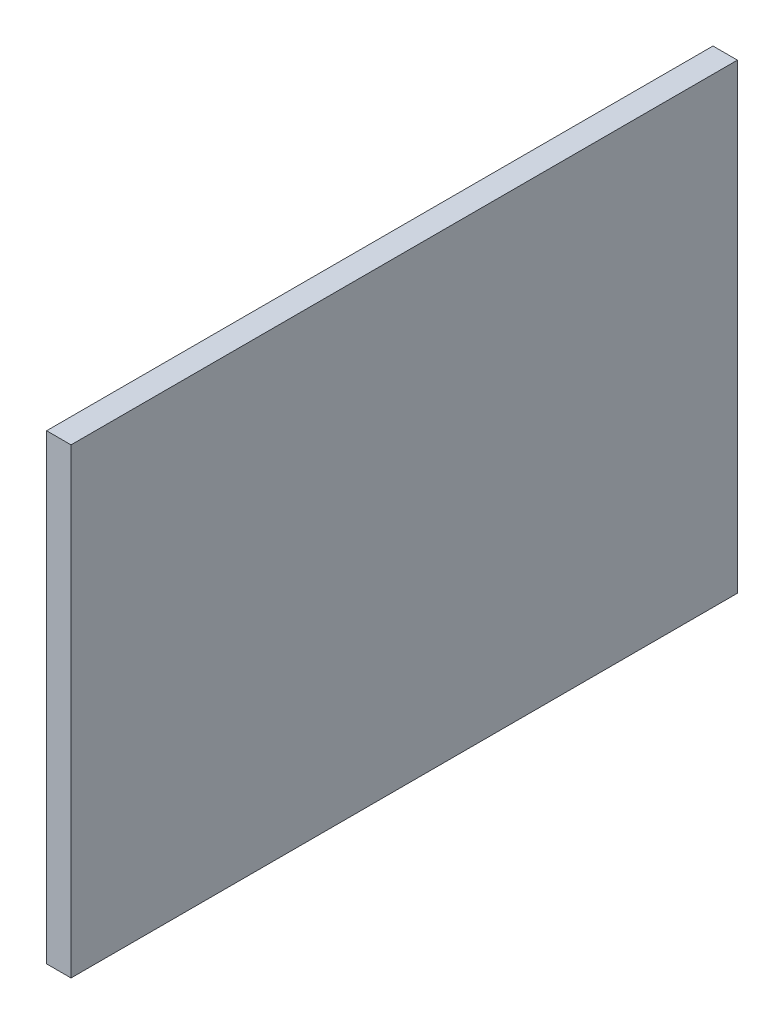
ISO-10303-21;
HEADER;
FILE_DESCRIPTION(('STEP AP214'),'2;1');
FILE_NAME('part.step','',(''),(''),'','','');
FILE_SCHEMA(('AUTOMOTIVE_DESIGN { 1 0 10303 214 1 1 1 1 }'));
ENDSEC;
DATA;
#1=APPLICATION_CONTEXT('core data for automotive mechanical design processes');
#2=APPLICATION_PROTOCOL_DEFINITION('international standard','automotive_design',2000,#1);
#3=PRODUCT_CONTEXT('',#1,'mechanical');
#4=PRODUCT('Part','Part','',(#3));
#5=PRODUCT_RELATED_PRODUCT_CATEGORY('part','',(#4));
#6=PRODUCT_DEFINITION_FORMATION('','',#4);
#7=PRODUCT_DEFINITION_CONTEXT('part definition',#1,'design');
#8=PRODUCT_DEFINITION('design','',#6,#7);
#9=PRODUCT_DEFINITION_SHAPE('','',#8);
#10=(LENGTH_UNIT() NAMED_UNIT(*) SI_UNIT(.MILLI.,.METRE.));
#11=(NAMED_UNIT(*) PLANE_ANGLE_UNIT() SI_UNIT($,.RADIAN.));
#12=(NAMED_UNIT(*) SI_UNIT($,.STERADIAN.) SOLID_ANGLE_UNIT());
#13=UNCERTAINTY_MEASURE_WITH_UNIT(LENGTH_MEASURE(1.E-05),#10,'distance_accuracy_value','');
#14=(GEOMETRIC_REPRESENTATION_CONTEXT(3) GLOBAL_UNCERTAINTY_ASSIGNED_CONTEXT((#13)) GLOBAL_UNIT_ASSIGNED_CONTEXT((#10,
#11,#12)) REPRESENTATION_CONTEXT('',''));
#15=CARTESIAN_POINT('',(0.,0.,0.));
#16=DIRECTION('',(0.,0.,1.));
#17=DIRECTION('',(1.,0.,0.));
#18=AXIS2_PLACEMENT_3D('',#15,#16,#17);
#19=CARTESIAN_POINT('',(263.000000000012,986.999999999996,-490.));
#20=DIRECTION('',(-1.,0.,0.));
#21=DIRECTION('',(0.,0.,1.));
#22=AXIS2_PLACEMENT_3D('',#19,#20,#21);
#23=PLANE('',#22);
#24=DIRECTION('',(0.,-1.,0.));
#25=VECTOR('',#24,1.);
#26=CARTESIAN_POINT('',(263.000000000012,986.999999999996,0.));
#27=LINE('',#26,#25);
#28=CARTESIAN_POINT('',(263.000000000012,986.999999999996,0.));
#29=VERTEX_POINT('',#28);
#30=CARTESIAN_POINT('',(263.000000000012,647.500000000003,0.));
#31=VERTEX_POINT('',#30);
#32=EDGE_CURVE('E97',#29,#31,#27,.T.);
#33=ORIENTED_EDGE('',*,*,#32,.F.);
#34=DIRECTION('',(0.,0.,1.));
#35=VECTOR('',#34,1.);
#36=CARTESIAN_POINT('',(263.000000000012,986.999999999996,-490.));
#37=LINE('',#36,#35);
#38=CARTESIAN_POINT('',(263.000000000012,986.999999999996,-490.));
#39=VERTEX_POINT('',#38);
#40=EDGE_CURVE('E11',#39,#29,#37,.T.);
#41=ORIENTED_EDGE('',*,*,#40,.F.);
#42=DIRECTION('',(0.,-1.,0.));
#43=VECTOR('',#42,1.);
#44=CARTESIAN_POINT('',(263.000000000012,986.999999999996,-490.));
#45=LINE('',#44,#43);
#46=CARTESIAN_POINT('',(263.000000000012,647.500000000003,-490.));
#47=VERTEX_POINT('',#46);
#48=EDGE_CURVE('E91',#39,#47,#45,.T.);
#49=ORIENTED_EDGE('',*,*,#48,.T.);
#50=DIRECTION('',(0.,0.,1.));
#51=VECTOR('',#50,1.);
#52=CARTESIAN_POINT('',(263.000000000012,647.500000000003,-490.));
#53=LINE('',#52,#51);
#54=EDGE_CURVE('E36',#47,#31,#53,.T.);
#55=ORIENTED_EDGE('',*,*,#54,.T.);
#56=EDGE_LOOP('',(#33,#41,#49,#55));
#57=FACE_BOUND('',#56,.T.);
#58=ADVANCED_FACE('F33',(#57),#23,.T.);
#59=CARTESIAN_POINT('',(263.000000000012,986.999999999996,-490.));
#60=DIRECTION('',(0.,1.,0.));
#61=DIRECTION('',(0.,0.,1.));
#62=AXIS2_PLACEMENT_3D('',#59,#60,#61);
#63=PLANE('',#62);
#64=DIRECTION('',(-1.,0.,0.));
#65=VECTOR('',#64,1.);
#66=CARTESIAN_POINT('',(263.000000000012,986.999999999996,0.));
#67=LINE('',#66,#65);
#68=CARTESIAN_POINT('',(280.978931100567,986.999999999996,0.));
#69=VERTEX_POINT('',#68);
#70=EDGE_CURVE('E93',#69,#29,#67,.T.);
#71=ORIENTED_EDGE('',*,*,#70,.F.);
#72=DIRECTION('',(0.,0.,1.));
#73=VECTOR('',#72,1.);
#74=CARTESIAN_POINT('',(280.978931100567,986.999999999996,-490.));
#75=LINE('',#74,#73);
#76=CARTESIAN_POINT('',(280.978931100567,986.999999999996,-490.));
#77=VERTEX_POINT('',#76);
#78=EDGE_CURVE('E42',#77,#69,#75,.T.);
#79=ORIENTED_EDGE('',*,*,#78,.F.);
#80=DIRECTION('',(-1.,0.,0.));
#81=VECTOR('',#80,1.);
#82=CARTESIAN_POINT('',(263.000000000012,986.999999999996,-490.));
#83=LINE('',#82,#81);
#84=EDGE_CURVE('E88',#77,#39,#83,.T.);
#85=ORIENTED_EDGE('',*,*,#84,.T.);
#86=ORIENTED_EDGE('',*,*,#40,.T.);
#87=EDGE_LOOP('',(#71,#79,#85,#86));
#88=FACE_BOUND('',#87,.T.);
#89=ADVANCED_FACE('F107',(#88),#63,.T.);
#90=CARTESIAN_POINT('',(280.978931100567,986.999999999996,-490.));
#91=DIRECTION('',(1.,0.,0.));
#92=DIRECTION('',(0.,0.,-1.));
#93=AXIS2_PLACEMENT_3D('',#90,#91,#92);
#94=PLANE('',#93);
#95=DIRECTION('',(0.,1.,0.));
#96=VECTOR('',#95,1.);
#97=CARTESIAN_POINT('',(280.978931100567,986.999999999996,0.));
#98=LINE('',#97,#96);
#99=CARTESIAN_POINT('',(280.978931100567,647.500000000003,0.));
#100=VERTEX_POINT('',#99);
#101=EDGE_CURVE('E83',#100,#69,#98,.T.);
#102=ORIENTED_EDGE('',*,*,#101,.F.);
#103=DIRECTION('',(0.,0.,1.));
#104=VECTOR('',#103,1.);
#105=CARTESIAN_POINT('',(280.978931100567,647.500000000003,-490.));
#106=LINE('',#105,#104);
#107=CARTESIAN_POINT('',(280.978931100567,647.500000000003,-490.));
#108=VERTEX_POINT('',#107);
#109=EDGE_CURVE('E78',#108,#100,#106,.T.);
#110=ORIENTED_EDGE('',*,*,#109,.F.);
#111=DIRECTION('',(0.,1.,0.));
#112=VECTOR('',#111,1.);
#113=CARTESIAN_POINT('',(280.978931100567,986.999999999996,-490.));
#114=LINE('',#113,#112);
#115=EDGE_CURVE('E81',#108,#77,#114,.T.);
#116=ORIENTED_EDGE('',*,*,#115,.T.);
#117=ORIENTED_EDGE('',*,*,#78,.T.);
#118=EDGE_LOOP('',(#102,#110,#116,#117));
#119=FACE_BOUND('',#118,.T.);
#120=ADVANCED_FACE('F80',(#119),#94,.T.);
#121=CARTESIAN_POINT('',(263.000000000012,647.500000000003,-490.));
#122=DIRECTION('',(0.,-1.,0.));
#123=DIRECTION('',(0.,0.,-1.));
#124=AXIS2_PLACEMENT_3D('',#121,#122,#123);
#125=PLANE('',#124);
#126=DIRECTION('',(1.,0.,0.));
#127=VECTOR('',#126,1.);
#128=CARTESIAN_POINT('',(263.000000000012,647.500000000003,0.));
#129=LINE('',#128,#127);
#130=EDGE_CURVE('E100',#31,#100,#129,.T.);
#131=ORIENTED_EDGE('',*,*,#130,.F.);
#132=ORIENTED_EDGE('',*,*,#54,.F.);
#133=DIRECTION('',(1.,0.,0.));
#134=VECTOR('',#133,1.);
#135=CARTESIAN_POINT('',(263.000000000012,647.500000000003,-490.));
#136=LINE('',#135,#134);
#137=EDGE_CURVE('E87',#47,#108,#136,.T.);
#138=ORIENTED_EDGE('',*,*,#137,.T.);
#139=ORIENTED_EDGE('',*,*,#109,.T.);
#140=EDGE_LOOP('',(#131,#132,#138,#139));
#141=FACE_BOUND('',#140,.T.);
#142=ADVANCED_FACE('F90',(#141),#125,.T.);
#143=CARTESIAN_POINT('',(0.,0.,-490.));
#144=DIRECTION('',(0.,0.,1.));
#145=DIRECTION('',(1.,0.,0.));
#146=AXIS2_PLACEMENT_3D('',#143,#144,#145);
#147=PLANE('',#146);
#148=ORIENTED_EDGE('',*,*,#48,.F.);
#149=ORIENTED_EDGE('',*,*,#84,.F.);
#150=ORIENTED_EDGE('',*,*,#115,.F.);
#151=ORIENTED_EDGE('',*,*,#137,.F.);
#152=EDGE_LOOP('',(#148,#149,#150,#151));
#153=FACE_BOUND('',#152,.T.);
#154=ADVANCED_FACE('F86',(#153),#147,.F.);
#155=CARTESIAN_POINT('',(0.,0.,0.));
#156=DIRECTION('',(0.,0.,1.));
#157=DIRECTION('',(1.,0.,0.));
#158=AXIS2_PLACEMENT_3D('',#155,#156,#157);
#159=PLANE('',#158);
#160=ORIENTED_EDGE('',*,*,#32,.T.);
#161=ORIENTED_EDGE('',*,*,#130,.T.);
#162=ORIENTED_EDGE('',*,*,#101,.T.);
#163=ORIENTED_EDGE('',*,*,#70,.T.);
#164=EDGE_LOOP('',(#160,#161,#162,#163));
#165=FACE_BOUND('',#164,.T.);
#166=ADVANCED_FACE('F106',(#165),#159,.T.);
#167=CLOSED_SHELL('',(#58,#89,#120,#142,#154,#166));
#168=MANIFOLD_SOLID_BREP('B2',#167);
#169=ADVANCED_BREP_SHAPE_REPRESENTATION('',(#18,#168),#14);
#170=SHAPE_DEFINITION_REPRESENTATION(#9,#169);
ENDSEC;
END-ISO-10303-21;
